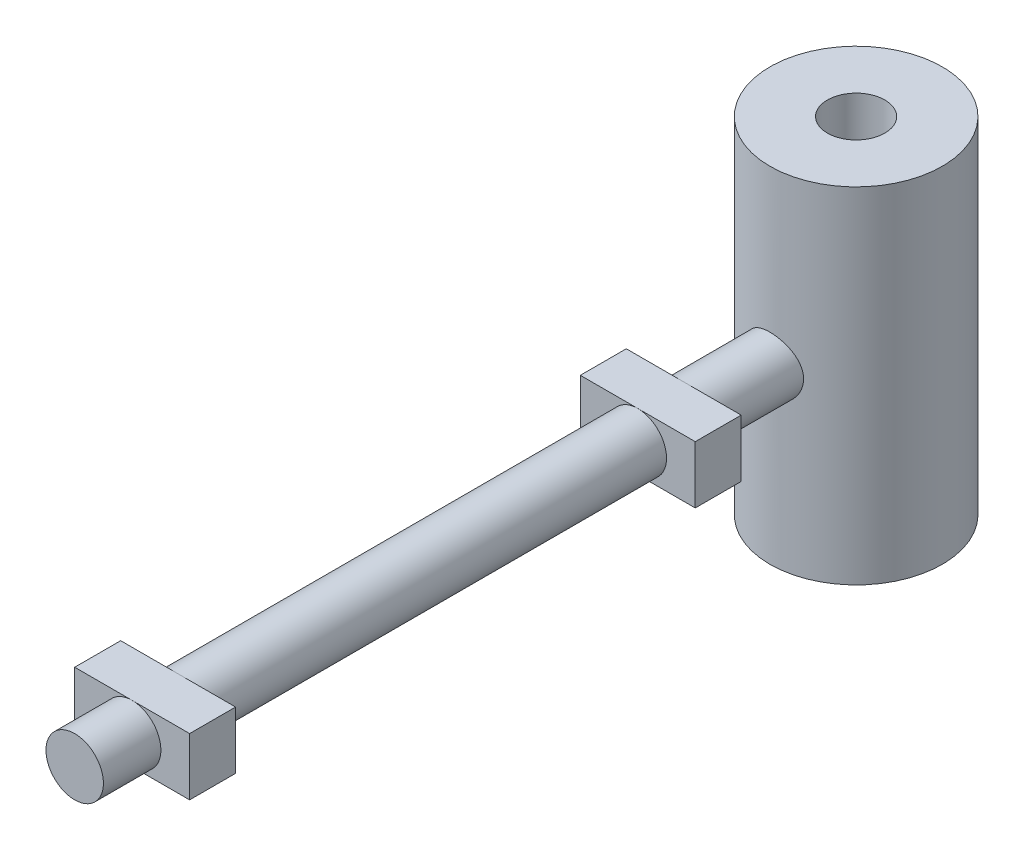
ISO-10303-21;
HEADER;
FILE_DESCRIPTION(('STEP AP214'),'2;1');
FILE_NAME('part.step','',(''),(''),'','','');
FILE_SCHEMA(('AUTOMOTIVE_DESIGN { 1 0 10303 214 1 1 1 1 }'));
ENDSEC;
DATA;
#1=APPLICATION_CONTEXT('core data for automotive mechanical design processes');
#2=APPLICATION_PROTOCOL_DEFINITION('international standard','automotive_design',2000,#1);
#3=PRODUCT_CONTEXT('',#1,'mechanical');
#4=PRODUCT('Part','Part','',(#3));
#5=PRODUCT_RELATED_PRODUCT_CATEGORY('part','',(#4));
#6=PRODUCT_DEFINITION_FORMATION('','',#4);
#7=PRODUCT_DEFINITION_CONTEXT('part definition',#1,'design');
#8=PRODUCT_DEFINITION('design','',#6,#7);
#9=PRODUCT_DEFINITION_SHAPE('','',#8);
#10=(LENGTH_UNIT() NAMED_UNIT(*) SI_UNIT(.MILLI.,.METRE.));
#11=(NAMED_UNIT(*) PLANE_ANGLE_UNIT() SI_UNIT($,.RADIAN.));
#12=(NAMED_UNIT(*) SI_UNIT($,.STERADIAN.) SOLID_ANGLE_UNIT());
#13=UNCERTAINTY_MEASURE_WITH_UNIT(LENGTH_MEASURE(1.E-05),#10,'distance_accuracy_value','');
#14=(GEOMETRIC_REPRESENTATION_CONTEXT(3) GLOBAL_UNCERTAINTY_ASSIGNED_CONTEXT((#13)) GLOBAL_UNIT_ASSIGNED_CONTEXT((#10,
#11,#12)) REPRESENTATION_CONTEXT('',''));
#15=CARTESIAN_POINT('',(0.,0.,0.));
#16=DIRECTION('',(0.,0.,1.));
#17=DIRECTION('',(1.,0.,0.));
#18=AXIS2_PLACEMENT_3D('',#15,#16,#17);
#19=CARTESIAN_POINT('',(0.,0.,-63.));
#20=DIRECTION('',(0.,0.,1.));
#21=DIRECTION('',(1.,0.,0.));
#22=AXIS2_PLACEMENT_3D('',#19,#20,#21);
#23=CYLINDRICAL_SURFACE('',#22,2.5);
#24=CARTESIAN_POINT('',(0.,0.,-48.));
#25=DIRECTION('',(0.,0.,-1.));
#26=DIRECTION('',(-1.,0.,0.));
#27=AXIS2_PLACEMENT_3D('',#24,#25,#26);
#28=CIRCLE('',#27,2.5);
#29=CARTESIAN_POINT('',(0.,2.5,-48.));
#30=VERTEX_POINT('',#29);
#31=CARTESIAN_POINT('',(0.,-2.5,-48.));
#32=VERTEX_POINT('',#31);
#33=EDGE_CURVE('E140',#30,#32,#28,.T.);
#34=ORIENTED_EDGE('',*,*,#33,.T.);
#35=EDGE_CURVE('E41',#32,#30,#28,.T.);
#36=ORIENTED_EDGE('',*,*,#35,.T.);
#37=EDGE_LOOP('',(#34,#36));
#38=FACE_BOUND('',#37,.T.);
#39=CARTESIAN_POINT('',(2.5,0.,-55.9289321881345));
#40=CARTESIAN_POINT('',(2.50000064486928,-0.13617043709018,-55.9289326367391));
#41=CARTESIAN_POINT('',(2.48883695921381,-0.272336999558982,-55.9249557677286));
#42=CARTESIAN_POINT('',(2.44462782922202,-0.540636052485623,-55.9095606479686));
#43=CARTESIAN_POINT('',(2.41157878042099,-0.672767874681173,-55.8981411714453));
#44=CARTESIAN_POINT('',(2.32488871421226,-0.92906723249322,-55.8692949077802));
#45=CARTESIAN_POINT('',(2.27128805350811,-1.05324982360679,-55.851879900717));
#46=CARTESIAN_POINT('',(2.14515407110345,-1.2909001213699,-55.8130219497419));
#47=CARTESIAN_POINT('',(2.07261657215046,-1.40436545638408,-55.7915781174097));
#48=CARTESIAN_POINT('',(1.9076278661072,-1.62179990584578,-55.7461377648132));
#49=CARTESIAN_POINT('',(1.8145608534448,-1.72528857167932,-55.7220776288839));
#50=CARTESIAN_POINT('',(1.61246916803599,-1.9155170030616,-55.6746533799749));
#51=CARTESIAN_POINT('',(1.50344193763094,-2.00225407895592,-55.651289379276));
#52=CARTESIAN_POINT('',(1.26901126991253,-2.15869724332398,-55.607153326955));
#53=CARTESIAN_POINT('',(1.14325477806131,-2.22789992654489,-55.5864648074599));
#54=CARTESIAN_POINT('',(0.881078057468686,-2.34397896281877,-55.5507603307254));
#55=CARTESIAN_POINT('',(0.744660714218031,-2.39086133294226,-55.5357428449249));
#56=CARTESIAN_POINT('',(0.470072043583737,-2.45933963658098,-55.5135231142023));
#57=CARTESIAN_POINT('',(0.332126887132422,-2.48175861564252,-55.506067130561));
#58=CARTESIAN_POINT('',(0.0542446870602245,-2.50329073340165,-55.4989097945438));
#59=CARTESIAN_POINT('',(-0.0856918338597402,-2.50240987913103,-55.4992064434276));
#60=CARTESIAN_POINT('',(-0.357758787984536,-2.47788936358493,-55.5073490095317));
#61=CARTESIAN_POINT('',(-0.48998012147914,-2.45514367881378,-55.5148983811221));
#62=CARTESIAN_POINT('',(-0.748608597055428,-2.38901754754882,-55.5363258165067));
#63=CARTESIAN_POINT('',(-0.875015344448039,-2.34563570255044,-55.5502043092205));
#64=CARTESIAN_POINT('',(-1.12038118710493,-2.23894670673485,-55.5831082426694));
#65=CARTESIAN_POINT('',(-1.23922055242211,-2.17538515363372,-55.6021989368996));
#66=CARTESIAN_POINT('',(-1.46481081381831,-2.03035073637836,-55.643540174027));
#67=CARTESIAN_POINT('',(-1.57155833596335,-1.94887289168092,-55.6657915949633));
#68=CARTESIAN_POINT('',(-1.77525216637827,-1.76581401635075,-55.7123452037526));
#69=CARTESIAN_POINT('',(-1.87150039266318,-1.6634671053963,-55.7366946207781));
#70=CARTESIAN_POINT('',(-2.04569314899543,-1.44387818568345,-55.7838166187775));
#71=CARTESIAN_POINT('',(-2.12363485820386,-1.32663388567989,-55.8065889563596));
#72=CARTESIAN_POINT('',(-2.25996863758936,-1.0783659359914,-55.8482368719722));
#73=CARTESIAN_POINT('',(-2.31806615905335,-0.947169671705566,-55.8670522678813));
#74=CARTESIAN_POINT('',(-2.41110798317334,-0.676071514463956,-55.8979587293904));
#75=CARTESIAN_POINT('',(-2.44606198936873,-0.536173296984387,-55.9100526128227));
#76=CARTESIAN_POINT('',(-2.4904032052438,-0.258404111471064,-55.9255090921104));
#77=CARTESIAN_POINT('',(-2.50087273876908,-0.12072643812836,-55.9292409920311));
#78=CARTESIAN_POINT('',(-2.4990135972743,0.154440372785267,-55.9285831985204));
#79=CARTESIAN_POINT('',(-2.48668906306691,0.291929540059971,-55.9241949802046));
#80=CARTESIAN_POINT('',(-2.44056412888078,0.557892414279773,-55.9081595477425));
#81=CARTESIAN_POINT('',(-2.40751598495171,0.686513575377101,-55.896766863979));
#82=CARTESIAN_POINT('',(-2.32178465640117,0.93635901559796,-55.8682861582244));
#83=CARTESIAN_POINT('',(-2.26909799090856,1.05758197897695,-55.851197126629));
#84=CARTESIAN_POINT('',(-2.14368585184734,1.29345105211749,-55.8125780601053));
#85=CARTESIAN_POINT('',(-2.07037779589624,1.4077666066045,-55.7909243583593));
#86=CARTESIAN_POINT('',(-1.9064640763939,1.6228651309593,-55.7458557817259));
#87=CARTESIAN_POINT('',(-1.81585331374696,1.72364409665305,-55.7224403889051));
#88=CARTESIAN_POINT('',(-1.61472926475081,1.9138199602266,-55.6751240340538));
#89=CARTESIAN_POINT('',(-1.50346817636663,2.00243597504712,-55.6512539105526));
#90=CARTESIAN_POINT('',(-1.26706822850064,2.15979035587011,-55.6068287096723));
#91=CARTESIAN_POINT('',(-1.14192986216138,2.22852942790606,-55.5862735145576));
#92=CARTESIAN_POINT('',(-0.881949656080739,2.34355026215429,-55.5508898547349));
#93=CARTESIAN_POINT('',(-0.747177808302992,2.38997819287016,-55.5360242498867));
#94=CARTESIAN_POINT('',(-0.471146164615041,2.45931935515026,-55.5135347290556));
#95=CARTESIAN_POINT('',(-0.329888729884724,2.48224107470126,-55.5059081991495));
#96=CARTESIAN_POINT('',(-0.0520383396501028,2.50315519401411,-55.4989534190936));
#97=CARTESIAN_POINT('',(0.0844618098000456,2.50226863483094,-55.499251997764));
#98=CARTESIAN_POINT('',(0.355277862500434,2.47835672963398,-55.507195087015));
#99=CARTESIAN_POINT('',(0.489593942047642,2.45533317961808,-55.5148390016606));
#100=CARTESIAN_POINT('',(0.750105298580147,2.38854441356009,-55.5364771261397));
#101=CARTESIAN_POINT('',(0.876395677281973,2.34511446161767,-55.5503685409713));
#102=CARTESIAN_POINT('',(1.11994587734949,2.23905617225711,-55.5830709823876));
#103=CARTESIAN_POINT('',(1.23720406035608,2.17642436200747,-55.6018828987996));
#104=CARTESIAN_POINT('',(1.46408504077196,2.03107621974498,-55.643353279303));
#105=CARTESIAN_POINT('',(1.57326562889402,1.9477032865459,-55.6661281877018));
#106=CARTESIAN_POINT('',(1.77645256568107,1.76435652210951,-55.712675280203));
#107=CARTESIAN_POINT('',(1.87045405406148,1.66437739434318,-55.7364477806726));
#108=CARTESIAN_POINT('',(2.0443545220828,1.44597661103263,-55.78341800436));
#109=CARTESIAN_POINT('',(2.12355741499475,1.3269862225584,-55.8065568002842));
#110=CARTESIAN_POINT('',(2.26078585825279,1.07666393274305,-55.8484951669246));
#111=CARTESIAN_POINT('',(2.31881694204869,0.945335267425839,-55.8672958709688));
#112=CARTESIAN_POINT('',(2.40960957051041,0.68009543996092,-55.8974666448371));
#113=CARTESIAN_POINT('',(2.4433947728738,0.546569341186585,-55.9091341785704));
#114=CARTESIAN_POINT('',(2.48858580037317,0.275359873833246,-55.924865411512));
#115=CARTESIAN_POINT('',(2.49999934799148,0.137677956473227,-55.9289317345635));
#116=CARTESIAN_POINT('',(2.5,0.,-55.9289321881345));
#117=B_SPLINE_CURVE_WITH_KNOTS('',3,(#39,#40,#41,#42,#43,#44,#45,#46,#47,#48,#49,#50,#51,#52,
#53,#54,#55,#56,#57,#58,#59,#60,#61,#62,#63,#64,#65,#66,#67,#68,#69,#70,#71,#72,#73,#74,#75,#76,
#77,#78,#79,#80,#81,#82,#83,#84,#85,#86,#87,#88,#89,#90,#91,#92,#93,#94,#95,#96,#97,#98,#99,
#100,#101,#102,#103,#104,#105,#106,#107,#108,#109,#110,#111,#112,#113,#114,#115,#116),
.UNSPECIFIED.,.T.,.F.,(4,2,2,2,2,2,2,2,2,2,2,2,2,2,2,2,2,2,2,2,2,2,2,2,2,2,2,2,2,2,2,2,2,2,2,2,
2,2,4),(0.,0.40800146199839,0.816070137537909,1.22334156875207,1.63070291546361,2.0525334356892,
2.4744316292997,2.90733765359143,3.34012690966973,3.75785796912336,4.17548133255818,
4.57672512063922,4.97799610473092,5.38454137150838,5.79119979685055,6.21700435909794,
6.64287449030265,7.07481599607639,7.50657628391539,7.91885728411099,8.33106339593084,
8.7291098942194,9.12722697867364,9.53797144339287,9.94883714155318,10.3794702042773,
10.8100879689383,11.2378447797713,11.6654470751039,12.0729521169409,12.4804241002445,
12.8814239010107,13.2824962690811,13.6983879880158,14.1144126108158,14.5467225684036,
14.9789194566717,15.3915803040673,15.8040986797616),.UNSPECIFIED.);
#118=CARTESIAN_POINT('',(2.5,0.,-55.9289321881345));
#119=VERTEX_POINT('',#118);
#120=EDGE_CURVE('E11',#119,#119,#117,.T.);
#121=ORIENTED_EDGE('',*,*,#120,.F.);
#122=EDGE_LOOP('',(#121));
#123=FACE_BOUND('',#122,.T.);
#124=ADVANCED_FACE('F32',(#38,#123),#23,.T.);
#125=CARTESIAN_POINT('',(5.,-2.5,-48.));
#126=DIRECTION('',(0.,0.,-1.));
#127=DIRECTION('',(-1.,0.,0.));
#128=AXIS2_PLACEMENT_3D('',#125,#126,#127);
#129=PLANE('',#128);
#130=ORIENTED_EDGE('',*,*,#33,.F.);
#131=DIRECTION('',(1.,0.,0.));
#132=VECTOR('',#131,1.);
#133=CARTESIAN_POINT('',(5.,2.5,-48.));
#134=LINE('',#133,#132);
#135=CARTESIAN_POINT('',(5.,2.5,-48.));
#136=VERTEX_POINT('',#135);
#137=EDGE_CURVE('E128',#30,#136,#134,.T.);
#138=ORIENTED_EDGE('',*,*,#137,.T.);
#139=DIRECTION('',(0.,-1.,0.));
#140=VECTOR('',#139,1.);
#141=CARTESIAN_POINT('',(5.,2.5,-48.));
#142=LINE('',#141,#140);
#143=CARTESIAN_POINT('',(5.,-2.5,-48.));
#144=VERTEX_POINT('',#143);
#145=EDGE_CURVE('E167',#136,#144,#142,.T.);
#146=ORIENTED_EDGE('',*,*,#145,.T.);
#147=DIRECTION('',(-1.,0.,0.));
#148=VECTOR('',#147,1.);
#149=CARTESIAN_POINT('',(5.,-2.5,-48.));
#150=LINE('',#149,#148);
#151=EDGE_CURVE('E142',#144,#32,#150,.T.);
#152=ORIENTED_EDGE('',*,*,#151,.T.);
#153=EDGE_LOOP('',(#130,#138,#146,#152));
#154=FACE_BOUND('',#153,.T.);
#155=ADVANCED_FACE('F141',(#154),#129,.T.);
#156=CARTESIAN_POINT('',(5.,2.5,-4.));
#157=DIRECTION('',(0.,0.,-1.));
#158=DIRECTION('',(-1.,0.,0.));
#159=AXIS2_PLACEMENT_3D('',#156,#157,#158);
#160=PLANE('',#159);
#161=CARTESIAN_POINT('',(0.,0.,-4.));
#162=DIRECTION('',(0.,0.,-1.));
#163=DIRECTION('',(-1.,0.,0.));
#164=AXIS2_PLACEMENT_3D('',#161,#162,#163);
#165=CIRCLE('',#164,2.5);
#166=CARTESIAN_POINT('',(0.,2.5,-4.));
#167=VERTEX_POINT('',#166);
#168=CARTESIAN_POINT('',(0.,-2.5,-4.));
#169=VERTEX_POINT('',#168);
#170=EDGE_CURVE('E152',#167,#169,#165,.T.);
#171=ORIENTED_EDGE('',*,*,#170,.F.);
#172=DIRECTION('',(1.,0.,0.));
#173=VECTOR('',#172,1.);
#174=CARTESIAN_POINT('',(5.,2.5,-4.));
#175=LINE('',#174,#173);
#176=CARTESIAN_POINT('',(5.,2.5,-4.));
#177=VERTEX_POINT('',#176);
#178=EDGE_CURVE('E205',#167,#177,#175,.T.);
#179=ORIENTED_EDGE('',*,*,#178,.T.);
#180=DIRECTION('',(0.,-1.,0.));
#181=VECTOR('',#180,1.);
#182=CARTESIAN_POINT('',(5.,2.5,-4.));
#183=LINE('',#182,#181);
#184=CARTESIAN_POINT('',(5.,-2.5,-4.));
#185=VERTEX_POINT('',#184);
#186=EDGE_CURVE('E196',#177,#185,#183,.T.);
#187=ORIENTED_EDGE('',*,*,#186,.T.);
#188=DIRECTION('',(-1.,0.,0.));
#189=VECTOR('',#188,1.);
#190=CARTESIAN_POINT('',(5.,-2.5,-4.));
#191=LINE('',#190,#189);
#192=EDGE_CURVE('E200',#185,#169,#191,.T.);
#193=ORIENTED_EDGE('',*,*,#192,.T.);
#194=EDGE_LOOP('',(#171,#179,#187,#193));
#195=FACE_BOUND('',#194,.T.);
#196=ADVANCED_FACE('F255',(#195),#160,.T.);
#197=CARTESIAN_POINT('',(0.,0.,5.));
#198=DIRECTION('',(0.,0.,-1.));
#199=DIRECTION('',(-1.,0.,0.));
#200=AXIS2_PLACEMENT_3D('',#197,#198,#199);
#201=CYLINDRICAL_SURFACE('',#200,2.5);
#202=CARTESIAN_POINT('',(0.,0.,5.));
#203=DIRECTION('',(0.,0.,1.));
#204=DIRECTION('',(1.,0.,0.));
#205=AXIS2_PLACEMENT_3D('',#202,#203,#204);
#206=CIRCLE('',#205,2.5);
#207=CARTESIAN_POINT('',(2.5,0.,5.));
#208=VERTEX_POINT('',#207);
#209=EDGE_CURVE('E150',#208,#208,#206,.T.);
#210=ORIENTED_EDGE('',*,*,#209,.F.);
#211=EDGE_LOOP('',(#210));
#212=FACE_BOUND('',#211,.T.);
#213=CARTESIAN_POINT('',(0.,0.,0.));
#214=DIRECTION('',(0.,0.,1.));
#215=DIRECTION('',(1.,0.,0.));
#216=AXIS2_PLACEMENT_3D('',#213,#214,#215);
#217=CIRCLE('',#216,2.5);
#218=CARTESIAN_POINT('',(0.,2.5,0.));
#219=VERTEX_POINT('',#218);
#220=CARTESIAN_POINT('',(0.,-2.5,0.));
#221=VERTEX_POINT('',#220);
#222=EDGE_CURVE('E221',#219,#221,#217,.T.);
#223=ORIENTED_EDGE('',*,*,#222,.T.);
#224=EDGE_CURVE('E220',#221,#219,#217,.T.);
#225=ORIENTED_EDGE('',*,*,#224,.T.);
#226=EDGE_LOOP('',(#223,#225));
#227=FACE_BOUND('',#226,.T.);
#228=ADVANCED_FACE('F34',(#212,#227),#201,.T.);
#229=CARTESIAN_POINT('',(0.,0.,5.));
#230=DIRECTION('',(0.,0.,1.));
#231=DIRECTION('',(1.,0.,0.));
#232=AXIS2_PLACEMENT_3D('',#229,#230,#231);
#233=PLANE('',#232);
#234=ORIENTED_EDGE('',*,*,#209,.T.);
#235=EDGE_LOOP('',(#234));
#236=FACE_BOUND('',#235,.T.);
#237=ADVANCED_FACE('F311',(#236),#233,.T.);
#238=CARTESIAN_POINT('',(5.,2.5,0.));
#239=DIRECTION('',(0.,0.,-1.));
#240=DIRECTION('',(-1.,0.,0.));
#241=AXIS2_PLACEMENT_3D('',#238,#239,#240);
#242=PLANE('',#241);
#243=ORIENTED_EDGE('',*,*,#222,.F.);
#244=DIRECTION('',(1.,0.,0.));
#245=VECTOR('',#244,1.);
#246=CARTESIAN_POINT('',(5.,2.5,0.));
#247=LINE('',#246,#245);
#248=CARTESIAN_POINT('',(-5.,2.5,0.));
#249=VERTEX_POINT('',#248);
#250=EDGE_CURVE('E194',#249,#219,#247,.T.);
#251=ORIENTED_EDGE('',*,*,#250,.F.);
#252=DIRECTION('',(0.,1.,0.));
#253=VECTOR('',#252,1.);
#254=CARTESIAN_POINT('',(-5.,2.5,0.));
#255=LINE('',#254,#253);
#256=CARTESIAN_POINT('',(-5.,-2.5,0.));
#257=VERTEX_POINT('',#256);
#258=EDGE_CURVE('E191',#257,#249,#255,.T.);
#259=ORIENTED_EDGE('',*,*,#258,.F.);
#260=DIRECTION('',(-1.,0.,0.));
#261=VECTOR('',#260,1.);
#262=CARTESIAN_POINT('',(5.,-2.5,0.));
#263=LINE('',#262,#261);
#264=EDGE_CURVE('E187',#221,#257,#263,.T.);
#265=ORIENTED_EDGE('',*,*,#264,.F.);
#266=EDGE_LOOP('',(#243,#251,#259,#265));
#267=FACE_BOUND('',#266,.T.);
#268=ADVANCED_FACE('F292',(#267),#242,.F.);
#269=CARTESIAN_POINT('',(5.,2.5,-4.));
#270=DIRECTION('',(-1.,0.,0.));
#271=DIRECTION('',(0.,-1.,0.));
#272=AXIS2_PLACEMENT_3D('',#269,#270,#271);
#273=PLANE('',#272);
#274=DIRECTION('',(0.,-1.,0.));
#275=VECTOR('',#274,1.);
#276=CARTESIAN_POINT('',(5.,2.5,0.));
#277=LINE('',#276,#275);
#278=CARTESIAN_POINT('',(5.,2.5,0.));
#279=VERTEX_POINT('',#278);
#280=CARTESIAN_POINT('',(5.,-2.5,0.));
#281=VERTEX_POINT('',#280);
#282=EDGE_CURVE('E184',#279,#281,#277,.T.);
#283=ORIENTED_EDGE('',*,*,#282,.T.);
#284=DIRECTION('',(0.,0.,1.));
#285=VECTOR('',#284,1.);
#286=CARTESIAN_POINT('',(5.,-2.5,-4.));
#287=LINE('',#286,#285);
#288=EDGE_CURVE('E217',#185,#281,#287,.T.);
#289=ORIENTED_EDGE('',*,*,#288,.F.);
#290=ORIENTED_EDGE('',*,*,#186,.F.);
#291=DIRECTION('',(0.,0.,1.));
#292=VECTOR('',#291,1.);
#293=CARTESIAN_POINT('',(5.,2.5,-4.));
#294=LINE('',#293,#292);
#295=EDGE_CURVE('E208',#177,#279,#294,.T.);
#296=ORIENTED_EDGE('',*,*,#295,.T.);
#297=EDGE_LOOP('',(#283,#289,#290,#296));
#298=FACE_BOUND('',#297,.T.);
#299=ADVANCED_FACE('F307',(#298),#273,.F.);
#300=CARTESIAN_POINT('',(5.,-2.5,-4.));
#301=DIRECTION('',(0.,1.,0.));
#302=DIRECTION('',(-1.,0.,0.));
#303=AXIS2_PLACEMENT_3D('',#300,#301,#302);
#304=PLANE('',#303);
#305=EDGE_CURVE('E188',#281,#221,#263,.T.);
#306=ORIENTED_EDGE('',*,*,#305,.T.);
#307=ORIENTED_EDGE('',*,*,#264,.T.);
#308=DIRECTION('',(0.,0.,1.));
#309=VECTOR('',#308,1.);
#310=CARTESIAN_POINT('',(-5.,-2.5,-4.));
#311=LINE('',#310,#309);
#312=CARTESIAN_POINT('',(-5.,-2.5,-4.));
#313=VERTEX_POINT('',#312);
#314=EDGE_CURVE('E214',#313,#257,#311,.T.);
#315=ORIENTED_EDGE('',*,*,#314,.F.);
#316=EDGE_CURVE('E199',#169,#313,#191,.T.);
#317=ORIENTED_EDGE('',*,*,#316,.F.);
#318=ORIENTED_EDGE('',*,*,#192,.F.);
#319=ORIENTED_EDGE('',*,*,#288,.T.);
#320=EDGE_LOOP('',(#306,#307,#315,#317,#318,#319));
#321=FACE_BOUND('',#320,.T.);
#322=ADVANCED_FACE('F303',(#321),#304,.F.);
#323=CARTESIAN_POINT('',(-5.,2.5,-4.));
#324=DIRECTION('',(1.,0.,0.));
#325=DIRECTION('',(0.,1.,0.));
#326=AXIS2_PLACEMENT_3D('',#323,#324,#325);
#327=PLANE('',#326);
#328=ORIENTED_EDGE('',*,*,#258,.T.);
#329=DIRECTION('',(0.,0.,1.));
#330=VECTOR('',#329,1.);
#331=CARTESIAN_POINT('',(-5.,2.5,-4.));
#332=LINE('',#331,#330);
#333=CARTESIAN_POINT('',(-5.,2.5,-4.));
#334=VERTEX_POINT('',#333);
#335=EDGE_CURVE('E211',#334,#249,#332,.T.);
#336=ORIENTED_EDGE('',*,*,#335,.F.);
#337=DIRECTION('',(0.,1.,0.));
#338=VECTOR('',#337,1.);
#339=CARTESIAN_POINT('',(-5.,2.5,-4.));
#340=LINE('',#339,#338);
#341=EDGE_CURVE('E203',#313,#334,#340,.T.);
#342=ORIENTED_EDGE('',*,*,#341,.F.);
#343=ORIENTED_EDGE('',*,*,#314,.T.);
#344=EDGE_LOOP('',(#328,#336,#342,#343));
#345=FACE_BOUND('',#344,.T.);
#346=ADVANCED_FACE('F299',(#345),#327,.F.);
#347=CARTESIAN_POINT('',(5.,2.5,-4.));
#348=DIRECTION('',(0.,-1.,0.));
#349=DIRECTION('',(0.,0.,-1.));
#350=AXIS2_PLACEMENT_3D('',#347,#348,#349);
#351=PLANE('',#350);
#352=ORIENTED_EDGE('',*,*,#250,.T.);
#353=EDGE_CURVE('E193',#219,#279,#247,.T.);
#354=ORIENTED_EDGE('',*,*,#353,.T.);
#355=ORIENTED_EDGE('',*,*,#295,.F.);
#356=ORIENTED_EDGE('',*,*,#178,.F.);
#357=EDGE_CURVE('E206',#334,#167,#175,.T.);
#358=ORIENTED_EDGE('',*,*,#357,.F.);
#359=ORIENTED_EDGE('',*,*,#335,.T.);
#360=EDGE_LOOP('',(#352,#354,#355,#356,#358,#359));
#361=FACE_BOUND('',#360,.T.);
#362=ADVANCED_FACE('F295',(#361),#351,.F.);
#363=EDGE_CURVE('E148',#169,#167,#165,.T.);
#364=ORIENTED_EDGE('',*,*,#363,.F.);
#365=ORIENTED_EDGE('',*,*,#316,.T.);
#366=ORIENTED_EDGE('',*,*,#341,.T.);
#367=ORIENTED_EDGE('',*,*,#357,.T.);
#368=EDGE_LOOP('',(#364,#365,#366,#367));
#369=FACE_BOUND('',#368,.T.);
#370=ADVANCED_FACE('F262',(#369),#160,.T.);
#371=ORIENTED_EDGE('',*,*,#224,.F.);
#372=ORIENTED_EDGE('',*,*,#305,.F.);
#373=ORIENTED_EDGE('',*,*,#282,.F.);
#374=ORIENTED_EDGE('',*,*,#353,.F.);
#375=EDGE_LOOP('',(#371,#372,#373,#374));
#376=FACE_BOUND('',#375,.T.);
#377=ADVANCED_FACE('F288',(#376),#242,.F.);
#378=CARTESIAN_POINT('',(0.,0.,-44.));
#379=DIRECTION('',(0.,0.,1.));
#380=DIRECTION('',(1.,0.,0.));
#381=AXIS2_PLACEMENT_3D('',#378,#379,#380);
#382=CYLINDRICAL_SURFACE('',#381,2.5);
#383=ORIENTED_EDGE('',*,*,#170,.T.);
#384=ORIENTED_EDGE('',*,*,#363,.T.);
#385=EDGE_LOOP('',(#383,#384));
#386=FACE_BOUND('',#385,.T.);
#387=CARTESIAN_POINT('',(0.,0.,-44.));
#388=DIRECTION('',(0.,0.,-1.));
#389=DIRECTION('',(-1.,0.,0.));
#390=AXIS2_PLACEMENT_3D('',#387,#388,#389);
#391=CIRCLE('',#390,2.5);
#392=CARTESIAN_POINT('',(0.,2.5,-44.));
#393=VERTEX_POINT('',#392);
#394=CARTESIAN_POINT('',(0.,-2.5,-44.));
#395=VERTEX_POINT('',#394);
#396=EDGE_CURVE('E182',#393,#395,#391,.T.);
#397=ORIENTED_EDGE('',*,*,#396,.F.);
#398=EDGE_CURVE('E54',#395,#393,#391,.T.);
#399=ORIENTED_EDGE('',*,*,#398,.F.);
#400=EDGE_LOOP('',(#397,#399));
#401=FACE_BOUND('',#400,.T.);
#402=ADVANCED_FACE('F284',(#386,#401),#382,.T.);
#403=CARTESIAN_POINT('',(5.,-2.5,-44.));
#404=DIRECTION('',(0.,0.,-1.));
#405=DIRECTION('',(-1.,0.,0.));
#406=AXIS2_PLACEMENT_3D('',#403,#404,#405);
#407=PLANE('',#406);
#408=DIRECTION('',(1.,0.,0.));
#409=VECTOR('',#408,1.);
#410=CARTESIAN_POINT('',(5.,2.5,-44.));
#411=LINE('',#410,#409);
#412=CARTESIAN_POINT('',(5.,2.5,-44.));
#413=VERTEX_POINT('',#412);
#414=EDGE_CURVE('E164',#393,#413,#411,.T.);
#415=ORIENTED_EDGE('',*,*,#414,.F.);
#416=ORIENTED_EDGE('',*,*,#396,.T.);
#417=DIRECTION('',(-1.,0.,0.));
#418=VECTOR('',#417,1.);
#419=CARTESIAN_POINT('',(5.,-2.5,-44.));
#420=LINE('',#419,#418);
#421=CARTESIAN_POINT('',(5.,-2.5,-44.));
#422=VERTEX_POINT('',#421);
#423=EDGE_CURVE('E159',#422,#395,#420,.T.);
#424=ORIENTED_EDGE('',*,*,#423,.F.);
#425=DIRECTION('',(0.,-1.,0.));
#426=VECTOR('',#425,1.);
#427=CARTESIAN_POINT('',(5.,2.5,-44.));
#428=LINE('',#427,#426);
#429=EDGE_CURVE('E144',#413,#422,#428,.T.);
#430=ORIENTED_EDGE('',*,*,#429,.F.);
#431=EDGE_LOOP('',(#415,#416,#424,#430));
#432=FACE_BOUND('',#431,.T.);
#433=ADVANCED_FACE('F287',(#432),#407,.F.);
#434=CARTESIAN_POINT('',(-5.,-2.5,-44.));
#435=VERTEX_POINT('',#434);
#436=EDGE_CURVE('E158',#395,#435,#420,.T.);
#437=ORIENTED_EDGE('',*,*,#436,.F.);
#438=ORIENTED_EDGE('',*,*,#398,.T.);
#439=CARTESIAN_POINT('',(-5.,2.5,-44.));
#440=VERTEX_POINT('',#439);
#441=EDGE_CURVE('E165',#440,#393,#411,.T.);
#442=ORIENTED_EDGE('',*,*,#441,.F.);
#443=DIRECTION('',(0.,1.,0.));
#444=VECTOR('',#443,1.);
#445=CARTESIAN_POINT('',(-5.,2.5,-44.));
#446=LINE('',#445,#444);
#447=EDGE_CURVE('E162',#435,#440,#446,.T.);
#448=ORIENTED_EDGE('',*,*,#447,.F.);
#449=EDGE_LOOP('',(#437,#438,#442,#448));
#450=FACE_BOUND('',#449,.T.);
#451=ADVANCED_FACE('F282',(#450),#407,.F.);
#452=CARTESIAN_POINT('',(5.,2.5,-48.));
#453=DIRECTION('',(-1.,0.,0.));
#454=DIRECTION('',(0.,0.,1.));
#455=AXIS2_PLACEMENT_3D('',#452,#453,#454);
#456=PLANE('',#455);
#457=ORIENTED_EDGE('',*,*,#429,.T.);
#458=DIRECTION('',(0.,0.,1.));
#459=VECTOR('',#458,1.);
#460=CARTESIAN_POINT('',(5.,-2.5,-48.));
#461=LINE('',#460,#459);
#462=EDGE_CURVE('E178',#144,#422,#461,.T.);
#463=ORIENTED_EDGE('',*,*,#462,.F.);
#464=ORIENTED_EDGE('',*,*,#145,.F.);
#465=DIRECTION('',(0.,0.,1.));
#466=VECTOR('',#465,1.);
#467=CARTESIAN_POINT('',(5.,2.5,-48.));
#468=LINE('',#467,#466);
#469=EDGE_CURVE('E127',#136,#413,#468,.T.);
#470=ORIENTED_EDGE('',*,*,#469,.T.);
#471=EDGE_LOOP('',(#457,#463,#464,#470));
#472=FACE_BOUND('',#471,.T.);
#473=ADVANCED_FACE('F278',(#472),#456,.F.);
#474=CARTESIAN_POINT('',(5.,-2.5,-48.));
#475=DIRECTION('',(0.,1.,0.));
#476=DIRECTION('',(0.,0.,1.));
#477=AXIS2_PLACEMENT_3D('',#474,#475,#476);
#478=PLANE('',#477);
#479=ORIENTED_EDGE('',*,*,#423,.T.);
#480=ORIENTED_EDGE('',*,*,#436,.T.);
#481=DIRECTION('',(0.,0.,1.));
#482=VECTOR('',#481,1.);
#483=CARTESIAN_POINT('',(-5.,-2.5,-48.));
#484=LINE('',#483,#482);
#485=CARTESIAN_POINT('',(-5.,-2.5,-48.));
#486=VERTEX_POINT('',#485);
#487=EDGE_CURVE('E175',#486,#435,#484,.T.);
#488=ORIENTED_EDGE('',*,*,#487,.F.);
#489=EDGE_CURVE('E169',#32,#486,#150,.T.);
#490=ORIENTED_EDGE('',*,*,#489,.F.);
#491=ORIENTED_EDGE('',*,*,#151,.F.);
#492=ORIENTED_EDGE('',*,*,#462,.T.);
#493=EDGE_LOOP('',(#479,#480,#488,#490,#491,#492));
#494=FACE_BOUND('',#493,.T.);
#495=ADVANCED_FACE('F272',(#494),#478,.F.);
#496=CARTESIAN_POINT('',(-5.,2.5,-48.));
#497=DIRECTION('',(1.,0.,0.));
#498=DIRECTION('',(0.,0.,-1.));
#499=AXIS2_PLACEMENT_3D('',#496,#497,#498);
#500=PLANE('',#499);
#501=ORIENTED_EDGE('',*,*,#447,.T.);
#502=DIRECTION('',(0.,0.,1.));
#503=VECTOR('',#502,1.);
#504=CARTESIAN_POINT('',(-5.,2.5,-48.));
#505=LINE('',#504,#503);
#506=CARTESIAN_POINT('',(-5.,2.5,-48.));
#507=VERTEX_POINT('',#506);
#508=EDGE_CURVE('E173',#507,#440,#505,.T.);
#509=ORIENTED_EDGE('',*,*,#508,.F.);
#510=DIRECTION('',(0.,1.,0.));
#511=VECTOR('',#510,1.);
#512=CARTESIAN_POINT('',(-5.,2.5,-48.));
#513=LINE('',#512,#511);
#514=EDGE_CURVE('E123',#486,#507,#513,.T.);
#515=ORIENTED_EDGE('',*,*,#514,.F.);
#516=ORIENTED_EDGE('',*,*,#487,.T.);
#517=EDGE_LOOP('',(#501,#509,#515,#516));
#518=FACE_BOUND('',#517,.T.);
#519=ADVANCED_FACE('F268',(#518),#500,.F.);
#520=CARTESIAN_POINT('',(5.,2.5,-48.));
#521=DIRECTION('',(0.,-1.,0.));
#522=DIRECTION('',(0.,0.,-1.));
#523=AXIS2_PLACEMENT_3D('',#520,#521,#522);
#524=PLANE('',#523);
#525=ORIENTED_EDGE('',*,*,#441,.T.);
#526=ORIENTED_EDGE('',*,*,#414,.T.);
#527=ORIENTED_EDGE('',*,*,#469,.F.);
#528=ORIENTED_EDGE('',*,*,#137,.F.);
#529=EDGE_CURVE('E119',#507,#30,#134,.T.);
#530=ORIENTED_EDGE('',*,*,#529,.F.);
#531=ORIENTED_EDGE('',*,*,#508,.T.);
#532=EDGE_LOOP('',(#525,#526,#527,#528,#530,#531));
#533=FACE_BOUND('',#532,.T.);
#534=ADVANCED_FACE('F133',(#533),#524,.F.);
#535=ORIENTED_EDGE('',*,*,#35,.F.);
#536=ORIENTED_EDGE('',*,*,#489,.T.);
#537=ORIENTED_EDGE('',*,*,#514,.T.);
#538=ORIENTED_EDGE('',*,*,#529,.T.);
#539=EDGE_LOOP('',(#535,#536,#537,#538));
#540=FACE_BOUND('',#539,.T.);
#541=ADVANCED_FACE('F121',(#540),#129,.T.);
#542=CARTESIAN_POINT('',(0.,15.,-63.));
#543=DIRECTION('',(0.,-1.,0.));
#544=DIRECTION('',(0.,0.,-1.));
#545=AXIS2_PLACEMENT_3D('',#542,#543,#544);
#546=CYLINDRICAL_SURFACE('',#545,7.50000000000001);
#547=CARTESIAN_POINT('',(0.,-15.,-63.));
#548=DIRECTION('',(0.,1.,0.));
#549=DIRECTION('',(0.,0.,1.));
#550=AXIS2_PLACEMENT_3D('',#547,#548,#549);
#551=CIRCLE('',#550,7.50000000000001);
#552=CARTESIAN_POINT('',(0.,-15.,-55.5));
#553=VERTEX_POINT('',#552);
#554=EDGE_CURVE('E492',#553,#553,#551,.T.);
#555=ORIENTED_EDGE('',*,*,#554,.T.);
#556=EDGE_LOOP('',(#555));
#557=FACE_BOUND('',#556,.T.);
#558=CARTESIAN_POINT('',(0.,15.,-63.));
#559=DIRECTION('',(0.,1.,0.));
#560=DIRECTION('',(0.,0.,1.));
#561=AXIS2_PLACEMENT_3D('',#558,#559,#560);
#562=CIRCLE('',#561,7.50000000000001);
#563=CARTESIAN_POINT('',(0.,15.,-55.5));
#564=VERTEX_POINT('',#563);
#565=EDGE_CURVE('E145',#564,#564,#562,.T.);
#566=ORIENTED_EDGE('',*,*,#565,.F.);
#567=EDGE_LOOP('',(#566));
#568=FACE_BOUND('',#567,.T.);
#569=ORIENTED_EDGE('',*,*,#120,.T.);
#570=EDGE_LOOP('',(#569));
#571=FACE_BOUND('',#570,.T.);
#572=ADVANCED_FACE('F231',(#557,#568,#571),#546,.T.);
#573=CARTESIAN_POINT('',(0.,15.,-63.));
#574=DIRECTION('',(0.,1.,0.));
#575=DIRECTION('',(0.,0.,1.));
#576=AXIS2_PLACEMENT_3D('',#573,#574,#575);
#577=PLANE('',#576);
#578=CARTESIAN_POINT('',(0.,15.,-63.));
#579=DIRECTION('',(0.,1.,0.));
#580=DIRECTION('',(0.,0.,1.));
#581=AXIS2_PLACEMENT_3D('',#578,#579,#580);
#582=CIRCLE('',#581,2.5);
#583=CARTESIAN_POINT('',(0.,15.,-60.5));
#584=VERTEX_POINT('',#583);
#585=EDGE_CURVE('E489',#584,#584,#582,.T.);
#586=ORIENTED_EDGE('',*,*,#585,.F.);
#587=EDGE_LOOP('',(#586));
#588=FACE_BOUND('',#587,.T.);
#589=ORIENTED_EDGE('',*,*,#565,.T.);
#590=EDGE_LOOP('',(#589));
#591=FACE_BOUND('',#590,.T.);
#592=ADVANCED_FACE('F235',(#588,#591),#577,.T.);
#593=CARTESIAN_POINT('',(0.,-15.,-63.));
#594=DIRECTION('',(0.,1.,0.));
#595=DIRECTION('',(0.,0.,1.));
#596=AXIS2_PLACEMENT_3D('',#593,#594,#595);
#597=PLANE('',#596);
#598=CARTESIAN_POINT('',(0.,-15.,-63.));
#599=DIRECTION('',(0.,1.,0.));
#600=DIRECTION('',(0.,0.,1.));
#601=AXIS2_PLACEMENT_3D('',#598,#599,#600);
#602=CIRCLE('',#601,2.5);
#603=CARTESIAN_POINT('',(0.,-15.,-60.5));
#604=VERTEX_POINT('',#603);
#605=EDGE_CURVE('E36',#604,#604,#602,.T.);
#606=ORIENTED_EDGE('',*,*,#605,.T.);
#607=EDGE_LOOP('',(#606));
#608=FACE_BOUND('',#607,.T.);
#609=ORIENTED_EDGE('',*,*,#554,.F.);
#610=EDGE_LOOP('',(#609));
#611=FACE_BOUND('',#610,.T.);
#612=ADVANCED_FACE('F239',(#608,#611),#597,.F.);
#613=CARTESIAN_POINT('',(0.,-25.,-63.));
#614=DIRECTION('',(0.,1.,0.));
#615=DIRECTION('',(0.,0.,1.));
#616=AXIS2_PLACEMENT_3D('',#613,#614,#615);
#617=CYLINDRICAL_SURFACE('',#616,2.5);
#618=ORIENTED_EDGE('',*,*,#585,.T.);
#619=EDGE_LOOP('',(#618));
#620=FACE_BOUND('',#619,.T.);
#621=ORIENTED_EDGE('',*,*,#605,.F.);
#622=EDGE_LOOP('',(#621));
#623=FACE_BOUND('',#622,.T.);
#624=ADVANCED_FACE('F243',(#620,#623),#617,.F.);
#625=CLOSED_SHELL('',(#124,#155,#196,#228,#237,#268,#299,#322,#346,#362,#370,#377,#402,#433,
#451,#473,#495,#519,#534,#541,#572,#592,#612,#624));
#626=MANIFOLD_SOLID_BREP('B2',#625);
#627=ADVANCED_BREP_SHAPE_REPRESENTATION('',(#18,#626),#14);
#628=SHAPE_DEFINITION_REPRESENTATION(#9,#627);
ENDSEC;
END-ISO-10303-21;
